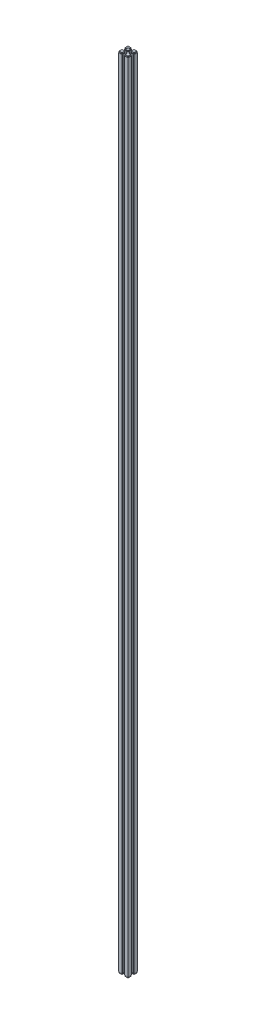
from build123d import *

# Parameters (mm, degrees)
EXTRUDE_1_DEPTH        = 628
EXTRUDE_2_DEPTH        = 2
EXTRUDE_3_DEPTH        = 2
FILLET_3_R             = 0.2
CUT_EXTRUDE_1_DEPTH    = 3
FILLET_4_R             = 0.2
FILLET_5_R             = 0.1
FILLET_3_OF_MIRROR_1_R = 0.2
FILLET_4_OF_MIRROR_1_R = 0.2
FILLET_5_OF_MIRROR_1_R = 0.1


with BuildPart() as part:
    # Sketch 1 → Extrude 1 (new body)
    with BuildSketch(Plane(origin=(0, 0, 0), x_dir=(1, 0, 0), z_dir=(0, 1, 0))):
        with BuildLine():
            Line((-7.5, 7.5), (-1.5, 7.5))
            Line((-1.5, 7.5), (-1.5, 6.822875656))
            ThreePointArc((-1.5, 6.822875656), (0, 3.5), (1.5, 6.822875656))
            Line((1.5, 6.822875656), (1.5, 7.5))
            Line((1.5, 7.5), (7.5, 7.5))
            Line((7.5, 7.5), (7.5, 1.5))
            Line((7.5, 1.5), (6.822875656, 1.5))
            ThreePointArc((6.822875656, 1.5), (3.5, 0), (6.822875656, -1.5))
            Line((6.822875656, -1.5), (7.5, -1.5))
            Line((7.5, -1.5), (7.5, -7.5))
            Line((7.5, -7.5), (1.5, -7.5))
            Line((1.5, -7.5), (1.5, -6.822875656))
            ThreePointArc((1.5, -6.822875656), (0, -3.5), (-1.5, -6.822875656))
            Line((-1.5, -6.822875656), (-1.5, -7.5))
            Line((-1.5, -7.5), (-7.5, -7.5))
            Line((-7.5, -7.5), (-7.5, -1.5))
            Line((-7.5, -1.5), (-6.822875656, -1.5))
            ThreePointArc((-6.822875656, -1.5), (-3.5, 0), (-6.822875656, 1.5))
            Line((-6.822875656, 1.5), (-7.5, 1.5))
            Line((-7.5, 1.5), (-7.5, 7.5))
        make_face()
    extrude_1 = extrude(amount=EXTRUDE_1_DEPTH)

    # Sketch 2 → Extrude 2 (add)
    with BuildSketch(Plane(origin=(0, 628, 0), x_dir=(1, 0, 0), z_dir=(0, 1, 0))):
        with BuildLine():
            Line((-7, 7), (-7, 2))
            ThreePointArc((-7, 2), (-3, 0), (-7, -2))
            Line((-7, -2), (-7, -7))
            Line((-7, -7), (-2, -7))
            ThreePointArc((-2, -7), (0, -3), (2, -7))
            Line((2, -7), (7, -7))
            Line((7, -7), (7, -2))
            ThreePointArc((7, -2), (3, 0), (7, 2))
            Line((7, 2), (7, 7))
            Line((7, 7), (2, 7))
            ThreePointArc((2, 7), (0, 3), (-2, 7))
            Line((-2, 7), (-7, 7))
        make_face()
    extrude_2 = extrude(amount=EXTRUDE_2_DEPTH)

    # Sketch 3 → Extrude 3 (add, symmetric)
    with BuildSketch(Plane(origin=(0, 0, 0), x_dir=(0, 0, -1), z_dir=(1, 0, 0))):
        with BuildLine():
            Line((-1.5, 630), (1.5, 630))
            Line((1.5, 630), (1.5, 630.677124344))
            ThreePointArc((1.5, 630.677124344), (1.780042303, 631.088161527), (1.95, 631.555590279))
            Line((1.95, 631.555590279), (1.95, 632.5))
            Line((1.95, 632.5), (-1.95, 632.5))
            Line((-1.95, 632.5), (-1.95, 631.555590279))
            ThreePointArc((-1.95, 631.555590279), (-1.780042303, 631.088161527), (-1.5, 630.677124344))
            Line((-1.5, 630.677124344), (-1.5, 630))
        make_face()
    extrude_3 = extrude(amount=EXTRUDE_3_DEPTH, both=True)

    # Fillet 3
    fillet_3_edges = [part.edges().sort_by_distance(p)[0] for p in [
        (-7.5, 314, -7.5),
        (-1.5, 314, -7.5),
        (1.5, 314, -7.5),
        (7.5, 314, -7.5),
        (7.5, 314, -1.5),
        (7.5, 314, 1.5),
        (7.5, 314, 7.5),
        (1.5, 314, 7.5),
        (-1.5, 314, 7.5),
        (-7.5, 314, 7.5),
        (-7.5, 314, 1.5),
        (-6.822875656, 314, -1.5),
        (-7.5, 314, -1.5),
    ]]
    fillet(fillet_3_edges, radius=FILLET_3_R)

    # Sketch 4 → Cut-Extrude 1 (cut, symmetric)
    with BuildSketch(Plane.XY):
        with BuildLine():
            Line((1.95, 632.5), (2, 632.5))
            Line((2, 632.5), (2, 630))
            Line((2, 630), (1.5, 630))
            Line((1.5, 630), (1.5, 630.677124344))
            ThreePointArc((1.5, 630.677124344), (1.780042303, 631.088161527), (1.95, 631.555590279))
            Line((1.95, 631.555590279), (1.95, 632.5))
        make_face()
        with BuildLine():
            Line((-1.95, 632.5), (-1.95, 631.555590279))
            ThreePointArc((-1.95, 631.555590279), (-1.780042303, 631.088161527), (-1.5, 630.677124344))
            Line((-1.5, 630.677124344), (-1.5, 630))
            Line((-1.5, 630), (-2, 630))
            Line((-2, 630), (-2, 632.5))
            Line((-2, 632.5), (-1.95, 632.5))
        make_face()
    cut_extrude_1 = extrude(amount=CUT_EXTRUDE_1_DEPTH, both=True, mode=Mode.SUBTRACT)

    # Fillet 4
    fillet_4_edges = [part.edges().sort_by_distance(p)[0] for p in [
        (-2, 629, -7),
        (-7, 629, -7),
        (-7, 629, -2),
        (-7, 629, 2),
        (-7, 629, 7),
        (-2, 629, 7),
        (2, 629, 7),
        (7, 629, 7),
        (7, 629, 2),
        (7, 629, -2),
        (7, 629, -7),
        (2, 629, -7),
        (-4.5, 630, -7),
        (-7, 630, -4.5),
        (-3, 630, 0),
        (-7, 630, 4.5),
        (-4.5, 630, 7),
        (0, 630, 3),
        (4.5, 630, 7),
        (7, 630, 4.5),
        (3, 630, 0),
        (7, 630, -4.5),
        (4.5, 630, -7),
        (0, 630, -3),
    ]]
    fillet(fillet_4_edges, radius=FILLET_4_R)

    # Fillet 5
    fillet_5_edges = [part.edges().sort_by_distance(p)[0] for p in [
        (1.95, 632.5, 0),
        (0, 632.5, -1.95),
        (0, 632.5, 1.95),
        (-1.95, 632.5, 0),
    ]]
    fillet(fillet_5_edges, radius=FILLET_5_R)

    # Mirror 1: Extrude 1, Extrude 2, Extrude 3, Cut-Extrude 1 across Top Plane
    add(extrude_1.mirror(Plane(origin=(0, 0, 0), x_dir=(1, 0, 0), z_dir=(0, 1, 0))))
    add(extrude_2.mirror(Plane(origin=(0, 0, 0), x_dir=(1, 0, 0), z_dir=(0, 1, 0))))
    add(extrude_3.mirror(Plane(origin=(0, 0, 0), x_dir=(1, 0, 0), z_dir=(0, 1, 0))))
    add(cut_extrude_1.mirror(Plane(origin=(0, 0, 0), x_dir=(1, 0, 0), z_dir=(0, 1, 0))), mode=Mode.SUBTRACT)

    # Fillet 3 of Mirror 1
    fillet_3_of_mirror_1_edges = [part.edges().sort_by_distance(p)[0] for p in [
        (-7.5, -314, -7.5),
        (-1.5, -314, -7.5),
        (1.5, -314, -7.5),
        (7.5, -314, -7.5),
        (7.5, -314, -1.5),
        (7.5, -314, 1.5),
        (7.5, -314, 7.5),
        (1.5, -314, 7.5),
        (-1.5, -314, 7.5),
        (-7.5, -314, 7.5),
        (-7.5, -314, 1.5),
        (-6.822875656, -314, -1.5),
        (-7.5, -314, -1.5),
    ]]
    fillet(fillet_3_of_mirror_1_edges, radius=FILLET_3_OF_MIRROR_1_R)

    # Fillet 4 of Mirror 1
    fillet_4_of_mirror_1_edges = [part.edges().sort_by_distance(p)[0] for p in [
        (-2, -629, -7),
        (-7, -629, -7),
        (-7, -629, -2),
        (-7, -629, 2),
        (-7, -629, 7),
        (-2, -629, 7),
        (2, -629, 7),
        (7, -629, 7),
        (7, -629, 2),
        (7, -629, -2),
        (7, -629, -7),
        (2, -629, -7),
        (-4.5, -630, -7),
        (-7, -630, -4.5),
        (-3, -630, 0),
        (-7, -630, 4.5),
        (-4.5, -630, 7),
        (0, -630, 3),
        (4.5, -630, 7),
        (7, -630, 4.5),
        (3, -630, 0),
        (7, -630, -4.5),
        (4.5, -630, -7),
        (0, -630, -3),
    ]]
    fillet(fillet_4_of_mirror_1_edges, radius=FILLET_4_OF_MIRROR_1_R)

    # Fillet 5 of Mirror 1
    fillet_5_of_mirror_1_edges = [part.edges().sort_by_distance(p)[0] for p in [
        (1.95, -632.5, 0),
        (0, -632.5, -1.95),
        (0, -632.5, 1.95),
        (-1.95, -632.5, 0),
    ]]
    fillet(fillet_5_of_mirror_1_edges, radius=FILLET_5_OF_MIRROR_1_R)


solid = part.part
